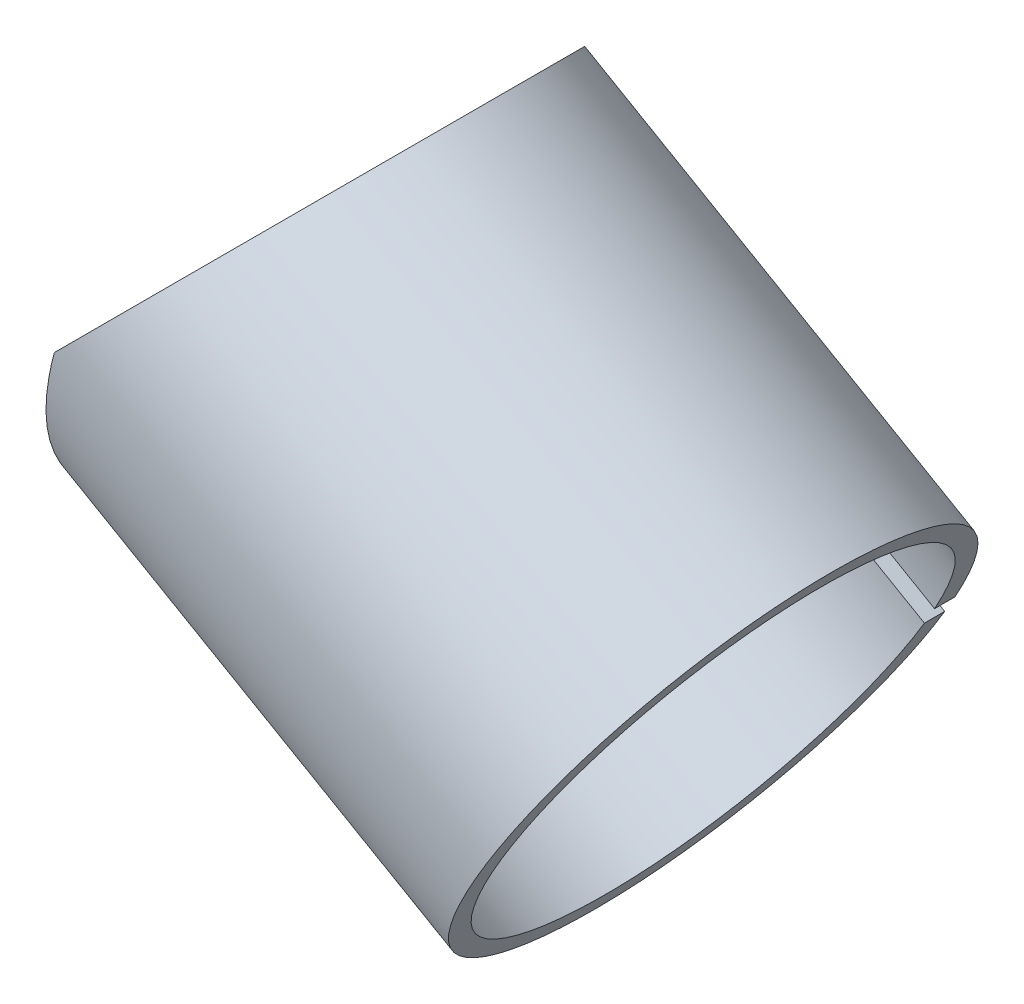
ISO-10303-21;
HEADER;
FILE_DESCRIPTION(('STEP AP214'),'2;1');
FILE_NAME('part.step','',(''),(''),'','','');
FILE_SCHEMA(('AUTOMOTIVE_DESIGN { 1 0 10303 214 1 1 1 1 }'));
ENDSEC;
DATA;
#1=APPLICATION_CONTEXT('core data for automotive mechanical design processes');
#2=APPLICATION_PROTOCOL_DEFINITION('international standard','automotive_design',2000,#1);
#3=PRODUCT_CONTEXT('',#1,'mechanical');
#4=PRODUCT('Part','Part','',(#3));
#5=PRODUCT_RELATED_PRODUCT_CATEGORY('part','',(#4));
#6=PRODUCT_DEFINITION_FORMATION('','',#4);
#7=PRODUCT_DEFINITION_CONTEXT('part definition',#1,'design');
#8=PRODUCT_DEFINITION('design','',#6,#7);
#9=PRODUCT_DEFINITION_SHAPE('','',#8);
#10=(LENGTH_UNIT() NAMED_UNIT(*) SI_UNIT(.MILLI.,.METRE.));
#11=(NAMED_UNIT(*) PLANE_ANGLE_UNIT() SI_UNIT($,.RADIAN.));
#12=(NAMED_UNIT(*) SI_UNIT($,.STERADIAN.) SOLID_ANGLE_UNIT());
#13=UNCERTAINTY_MEASURE_WITH_UNIT(LENGTH_MEASURE(1.E-05),#10,'distance_accuracy_value','');
#14=(GEOMETRIC_REPRESENTATION_CONTEXT(3) GLOBAL_UNCERTAINTY_ASSIGNED_CONTEXT((#13)) GLOBAL_UNIT_ASSIGNED_CONTEXT((#10,
#11,#12)) REPRESENTATION_CONTEXT('',''));
#15=CARTESIAN_POINT('',(0.,0.,0.));
#16=DIRECTION('',(0.,0.,1.));
#17=DIRECTION('',(1.,0.,0.));
#18=AXIS2_PLACEMENT_3D('',#15,#16,#17);
#19=CARTESIAN_POINT('',(34.6410161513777,-19.9999999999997,0.));
#20=DIRECTION('',(-0.866025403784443,0.499999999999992,0.));
#21=DIRECTION('',(0.,0.,-1.));
#22=AXIS2_PLACEMENT_3D('',#19,#20,#21);
#23=CYLINDRICAL_SURFACE('',#22,11.6658295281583);
#24=CARTESIAN_POINT('',(13.8564064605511,-7.99999999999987,0.));
#25=DIRECTION('',(-0.965925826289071,0.258819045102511,0.));
#26=DIRECTION('',(0.258819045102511,0.965925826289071,0.));
#27=AXIS2_PLACEMENT_3D('',#24,#25,#26);
#28=ELLIPSE('',#27,12.0773554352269,11.6658295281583);
#29=CARTESIAN_POINT('',(13.7224318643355,-8.49999999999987,-11.6551095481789));
#30=VERTEX_POINT('',#29);
#31=CARTESIAN_POINT('',(13.8564064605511,-7.99999999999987,11.6658295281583));
#32=VERTEX_POINT('',#31);
#33=EDGE_CURVE('E98',#30,#32,#28,.T.);
#34=ORIENTED_EDGE('',*,*,#33,.F.);
#35=DIRECTION('',(-0.866025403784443,0.499999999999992,0.));
#36=VECTOR('',#35,1.);
#37=CARTESIAN_POINT('',(34.3910161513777,-20.4330127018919,-11.6551095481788));
#38=LINE('',#37,#36);
#39=CARTESIAN_POINT('',(34.3910161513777,-20.4330127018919,-11.6551095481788));
#40=VERTEX_POINT('',#39);
#41=EDGE_CURVE('E43',#30,#40,#38,.F.);
#42=ORIENTED_EDGE('',*,*,#41,.T.);
#43=CARTESIAN_POINT('',(34.6410161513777,-19.9999999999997,0.));
#44=DIRECTION('',(0.866025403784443,-0.499999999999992,0.));
#45=DIRECTION('',(0.,0.,1.));
#46=AXIS2_PLACEMENT_3D('',#43,#44,#45);
#47=CIRCLE('',#46,11.6658295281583);
#48=CARTESIAN_POINT('',(34.8910161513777,-19.5669872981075,-11.6551095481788));
#49=VERTEX_POINT('',#48);
#50=EDGE_CURVE('E87',#49,#40,#47,.T.);
#51=ORIENTED_EDGE('',*,*,#50,.F.);
#52=DIRECTION('',(-0.866025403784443,0.499999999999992,0.));
#53=VECTOR('',#52,1.);
#54=CARTESIAN_POINT('',(34.8910161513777,-19.5669872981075,-11.6551095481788));
#55=LINE('',#54,#53);
#56=CARTESIAN_POINT('',(14.2224318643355,-7.63397459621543,-11.6551095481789));
#57=VERTEX_POINT('',#56);
#58=EDGE_CURVE('E73',#57,#49,#55,.F.);
#59=ORIENTED_EDGE('',*,*,#58,.F.);
#60=CARTESIAN_POINT('',(13.8564064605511,-7.99999999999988,0.));
#61=DIRECTION('',(-0.707106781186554,0.707106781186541,0.));
#62=DIRECTION('',(-0.707106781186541,-0.707106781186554,0.));
#63=AXIS2_PLACEMENT_3D('',#60,#61,#62);
#64=ELLIPSE('',#63,12.0773554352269,11.6658295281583);
#65=EDGE_CURVE('E107',#32,#57,#64,.T.);
#66=ORIENTED_EDGE('',*,*,#65,.F.);
#67=EDGE_LOOP('',(#34,#42,#51,#59,#66));
#68=FACE_BOUND('',#67,.T.);
#69=ADVANCED_FACE('F30',(#68),#23,.T.);
#70=CARTESIAN_POINT('',(22.3963863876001,0.539979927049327,-11.6658295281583));
#71=DIRECTION('',(-0.707106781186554,0.707106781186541,0.));
#72=DIRECTION('',(-0.707106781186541,-0.707106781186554,0.));
#73=AXIS2_PLACEMENT_3D('',#70,#71,#72);
#74=PLANE('',#73);
#75=ORIENTED_EDGE('',*,*,#65,.T.);
#76=DIRECTION('',(0.,0.,1.));
#77=VECTOR('',#76,1.);
#78=CARTESIAN_POINT('',(14.2224318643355,-7.63397459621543,-11.6658295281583));
#79=LINE('',#78,#77);
#80=CARTESIAN_POINT('',(14.2224318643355,-7.63397459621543,-10.654103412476));
#81=VERTEX_POINT('',#80);
#82=EDGE_CURVE('E37',#57,#81,#79,.T.);
#83=ORIENTED_EDGE('',*,*,#82,.T.);
#84=CARTESIAN_POINT('',(13.8564064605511,-7.99999999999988,0.));
#85=DIRECTION('',(-0.707106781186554,0.707106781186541,0.));
#86=DIRECTION('',(-0.707106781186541,-0.707106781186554,0.));
#87=AXIS2_PLACEMENT_3D('',#84,#85,#86);
#88=ELLIPSE('',#87,11.0420792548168,10.6658295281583);
#89=CARTESIAN_POINT('',(13.8564064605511,-7.99999999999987,10.6658295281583));
#90=VERTEX_POINT('',#89);
#91=EDGE_CURVE('E93',#90,#81,#88,.T.);
#92=ORIENTED_EDGE('',*,*,#91,.F.);
#93=DIRECTION('',(0.,0.,1.));
#94=VECTOR('',#93,1.);
#95=CARTESIAN_POINT('',(13.8564064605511,-7.99999999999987,-11.6658295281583));
#96=LINE('',#95,#94);
#97=EDGE_CURVE('E115',#90,#32,#96,.T.);
#98=ORIENTED_EDGE('',*,*,#97,.T.);
#99=EDGE_LOOP('',(#75,#83,#92,#98));
#100=FACE_BOUND('',#99,.T.);
#101=ADVANCED_FACE('F104',(#100),#74,.T.);
#102=CARTESIAN_POINT('',(34.6410161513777,-19.9999999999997,0.));
#103=DIRECTION('',(-0.866025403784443,0.499999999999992,0.));
#104=DIRECTION('',(0.,0.,-1.));
#105=AXIS2_PLACEMENT_3D('',#102,#103,#104);
#106=CYLINDRICAL_SURFACE('',#105,10.6658295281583);
#107=DIRECTION('',(-0.866025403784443,0.499999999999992,0.));
#108=VECTOR('',#107,1.);
#109=CARTESIAN_POINT('',(34.3910161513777,-20.4330127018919,-10.654103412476));
#110=LINE('',#109,#108);
#111=CARTESIAN_POINT('',(13.7224318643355,-8.49999999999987,-10.654103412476));
#112=VERTEX_POINT('',#111);
#113=CARTESIAN_POINT('',(34.3910161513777,-20.4330127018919,-10.654103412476));
#114=VERTEX_POINT('',#113);
#115=EDGE_CURVE('E112',#112,#114,#110,.F.);
#116=ORIENTED_EDGE('',*,*,#115,.F.);
#117=CARTESIAN_POINT('',(13.8564064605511,-7.99999999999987,0.));
#118=DIRECTION('',(-0.965925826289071,0.258819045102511,0.));
#119=DIRECTION('',(0.258819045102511,0.965925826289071,0.));
#120=AXIS2_PLACEMENT_3D('',#117,#118,#119);
#121=ELLIPSE('',#120,11.0420792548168,10.6658295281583);
#122=EDGE_CURVE('E96',#112,#90,#121,.T.);
#123=ORIENTED_EDGE('',*,*,#122,.T.);
#124=ORIENTED_EDGE('',*,*,#91,.T.);
#125=DIRECTION('',(-0.866025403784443,0.499999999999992,0.));
#126=VECTOR('',#125,1.);
#127=CARTESIAN_POINT('',(34.8910161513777,-19.5669872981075,-10.654103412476));
#128=LINE('',#127,#126);
#129=CARTESIAN_POINT('',(34.8910161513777,-19.5669872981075,-10.654103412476));
#130=VERTEX_POINT('',#129);
#131=EDGE_CURVE('E51',#81,#130,#128,.F.);
#132=ORIENTED_EDGE('',*,*,#131,.T.);
#133=CARTESIAN_POINT('',(34.6410161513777,-19.9999999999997,0.));
#134=DIRECTION('',(0.866025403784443,-0.499999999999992,0.));
#135=DIRECTION('',(-0.499999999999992,-0.866025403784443,0.));
#136=AXIS2_PLACEMENT_3D('',#133,#134,#135);
#137=CIRCLE('',#136,10.6658295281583);
#138=EDGE_CURVE('E89',#130,#114,#137,.T.);
#139=ORIENTED_EDGE('',*,*,#138,.T.);
#140=EDGE_LOOP('',(#116,#123,#124,#132,#139));
#141=FACE_BOUND('',#140,.T.);
#142=ADVANCED_FACE('F110',(#141),#106,.F.);
#143=CARTESIAN_POINT('',(34.6410161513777,-19.9999999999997,0.));
#144=DIRECTION('',(0.866025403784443,-0.499999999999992,0.));
#145=DIRECTION('',(0.,0.,1.));
#146=AXIS2_PLACEMENT_3D('',#143,#144,#145);
#147=PLANE('',#146);
#148=DIRECTION('',(0.,0.,1.));
#149=VECTOR('',#148,1.);
#150=CARTESIAN_POINT('',(34.3910161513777,-20.4330127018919,-11.6658295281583));
#151=LINE('',#150,#149);
#152=EDGE_CURVE('E90',#40,#114,#151,.T.);
#153=ORIENTED_EDGE('',*,*,#152,.T.);
#154=ORIENTED_EDGE('',*,*,#138,.F.);
#155=DIRECTION('',(0.,0.,1.));
#156=VECTOR('',#155,1.);
#157=CARTESIAN_POINT('',(34.8910161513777,-19.5669872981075,-11.6658295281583));
#158=LINE('',#157,#156);
#159=EDGE_CURVE('E76',#49,#130,#158,.T.);
#160=ORIENTED_EDGE('',*,*,#159,.F.);
#161=ORIENTED_EDGE('',*,*,#50,.T.);
#162=EDGE_LOOP('',(#153,#154,#160,#161));
#163=FACE_BOUND('',#162,.T.);
#164=ADVANCED_FACE('F86',(#163),#147,.T.);
#165=CARTESIAN_POINT('',(13.8564064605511,-7.99999999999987,-11.6658295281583));
#166=DIRECTION('',(-0.965925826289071,0.258819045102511,0.));
#167=DIRECTION('',(-0.258819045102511,-0.965925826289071,0.));
#168=AXIS2_PLACEMENT_3D('',#165,#166,#167);
#169=PLANE('',#168);
#170=DIRECTION('',(0.,0.,1.));
#171=VECTOR('',#170,1.);
#172=CARTESIAN_POINT('',(13.7224318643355,-8.49999999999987,-11.6658295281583));
#173=LINE('',#172,#171);
#174=EDGE_CURVE('E11',#30,#112,#173,.T.);
#175=ORIENTED_EDGE('',*,*,#174,.F.);
#176=ORIENTED_EDGE('',*,*,#33,.T.);
#177=ORIENTED_EDGE('',*,*,#97,.F.);
#178=ORIENTED_EDGE('',*,*,#122,.F.);
#179=EDGE_LOOP('',(#175,#176,#177,#178));
#180=FACE_BOUND('',#179,.T.);
#181=ADVANCED_FACE('F114',(#180),#169,.T.);
#182=CARTESIAN_POINT('',(0.249999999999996,0.433012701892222,-11.6658295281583));
#183=DIRECTION('',(-0.499999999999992,-0.866025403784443,0.));
#184=DIRECTION('',(0.,0.,-1.));
#185=AXIS2_PLACEMENT_3D('',#182,#183,#184);
#186=PLANE('',#185);
#187=ORIENTED_EDGE('',*,*,#82,.F.);
#188=ORIENTED_EDGE('',*,*,#58,.T.);
#189=ORIENTED_EDGE('',*,*,#159,.T.);
#190=ORIENTED_EDGE('',*,*,#131,.F.);
#191=EDGE_LOOP('',(#187,#188,#189,#190));
#192=FACE_BOUND('',#191,.T.);
#193=ADVANCED_FACE('F75',(#192),#186,.T.);
#194=CARTESIAN_POINT('',(-0.249999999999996,-0.433012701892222,-11.6658295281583));
#195=DIRECTION('',(-0.499999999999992,-0.866025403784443,0.));
#196=DIRECTION('',(0.,0.,-1.));
#197=AXIS2_PLACEMENT_3D('',#194,#195,#196);
#198=PLANE('',#197);
#199=ORIENTED_EDGE('',*,*,#115,.T.);
#200=ORIENTED_EDGE('',*,*,#152,.F.);
#201=ORIENTED_EDGE('',*,*,#41,.F.);
#202=ORIENTED_EDGE('',*,*,#174,.T.);
#203=EDGE_LOOP('',(#199,#200,#201,#202));
#204=FACE_BOUND('',#203,.T.);
#205=ADVANCED_FACE('F122',(#204),#198,.F.);
#206=CLOSED_SHELL('',(#69,#101,#142,#164,#181,#193,#205));
#207=MANIFOLD_SOLID_BREP('B2',#206);
#208=ADVANCED_BREP_SHAPE_REPRESENTATION('',(#18,#207),#14);
#209=SHAPE_DEFINITION_REPRESENTATION(#9,#208);
ENDSEC;
END-ISO-10303-21;
